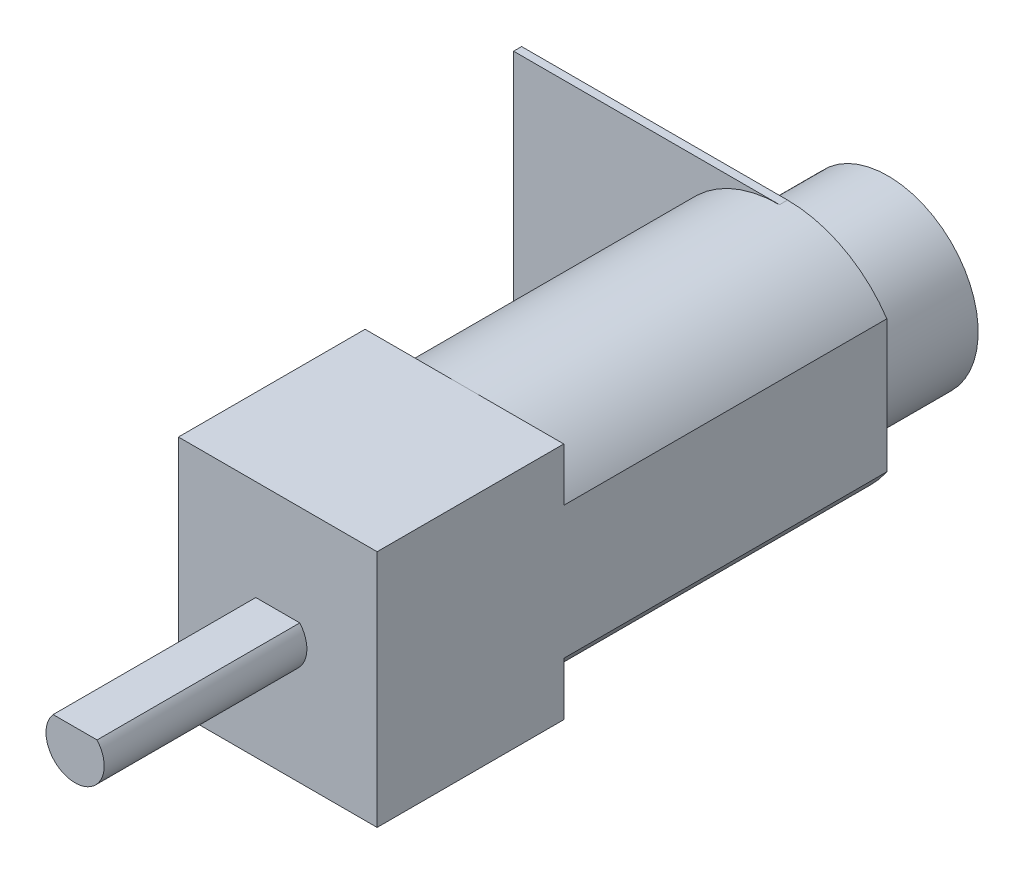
from build123d import *

# Parameters (mm, degrees)
SKETCH_1_W      = 9.9
SKETCH_1_H      = 11.9
EXTRUDE_1_DEPTH = 9.3
EXTRUDE_2_DEPTH = 15.7
EXTRUDE_3_DEPTH = 0.4
SKETCH_4_R      = 4.5
EXTRUDE_4_DEPTH = 5
EXTRUDE_5_DEPTH = 10.1


with BuildPart() as part:
    # Sketch 1 → Extrude 1 (new body)
    with BuildSketch(Plane.XY):
        Rectangle(SKETCH_1_W, SKETCH_1_H)
    extrude(amount=EXTRUDE_1_DEPTH)

    # Sketch 2 → Extrude 2 (add)
    with BuildSketch(Plane(origin=(0, 0, 0), x_dir=(-1, 0, 0), z_dir=(0, 0, -1))):
        with BuildLine():
            ThreePointArc((-4.95, -3.301514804), (-2.806999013, -5.246261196), (0, -5.95))
            ThreePointArc((0, -5.95), (2.806999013, -5.246261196), (4.95, -3.301514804))
            Line((4.95, -3.301514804), (4.95, 3.301514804))
            ThreePointArc((4.95, 3.301514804), (2.806999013, 5.246261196), (0, 5.95))
            ThreePointArc((0, 5.95), (-2.806999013, 5.246261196), (-4.95, 3.301514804))
            Line((-4.95, 3.301514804), (-4.95, -3.301514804))
        make_face()
    extrude(amount=EXTRUDE_2_DEPTH)

    # Sketch 3 → Extrude 3 (add)
    with BuildSketch(Plane(origin=(0, 0, -15.7), x_dir=(-1, 0, 0), z_dir=(0, 0, -1))):
        with BuildLine():
            ThreePointArc((-4.95, -3.301514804), (0, -5.95), (4.95, -3.301514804))
            Line((4.95, -3.301514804), (4.95, 3.301514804))
            ThreePointArc((4.95, 3.301514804), (0, 5.95), (-4.95, 3.301514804))
            Line((-4.95, 3.301514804), (-4.95, -3.301514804))
        make_face()
        with BuildLine():
            Line((13.25, -5.95), (13.25, 5.95))
            Line((13.25, 5.95), (0, 5.95))
            ThreePointArc((0, 5.95), (2.806999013, 5.246261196), (4.95, 3.301514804))
            Line((4.95, 3.301514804), (4.95, -3.301514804))
            ThreePointArc((4.95, -3.301514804), (2.806999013, -5.246261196), (0, -5.95))
            Line((0, -5.95), (13.25, -5.95))
        make_face()
    extrude(amount=EXTRUDE_3_DEPTH)

    # Sketch 4 → Extrude 4 (add)
    with BuildSketch(Plane(origin=(0, 0, -16.1), x_dir=(-1, 0, 0), z_dir=(0, 0, -1))):
        Circle(SKETCH_4_R)
    extrude(amount=EXTRUDE_4_DEPTH)

    # Sketch 5 → Extrude 5 (add)
    with BuildSketch(Plane.XY.offset(9.3)):
        with BuildLine():
            Line((1.095445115, 0.95), (-1.095445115, 0.95))
            ThreePointArc((-1.095445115, 0.95), (-0.507003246, -1.358472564), (1.45, 0))
            ThreePointArc((1.45, 0), (1.358472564, 0.507003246), (1.095445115, 0.95))
        make_face()
    extrude(amount=EXTRUDE_5_DEPTH)


solid = part.part
